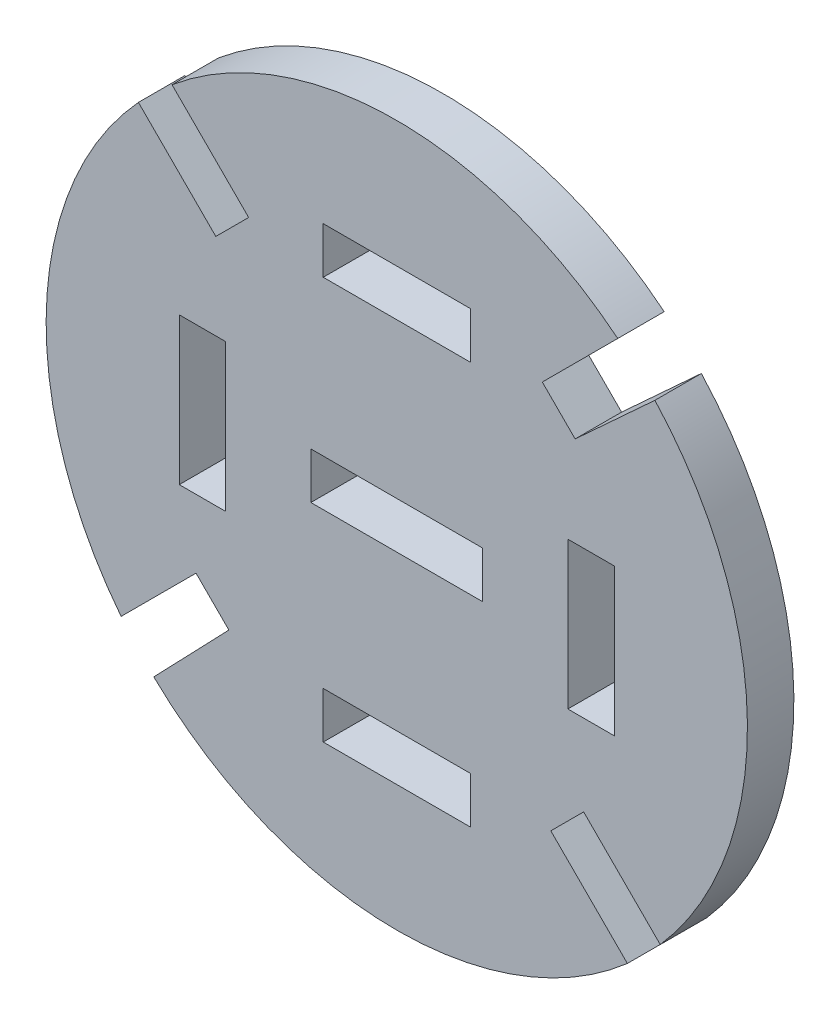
from build123d import *

# Parameters (mm, degrees)
SKETCH1_W           = 11.1
SKETCH1_H           = 3
SKETCH1_W_2         = 9.5
SKETCH1_W_3         = 3
SKETCH1_H_2         = 9.5
BOSS_EXTRUDE1_DEPTH = 3


with BuildPart() as part:
    # Sketch1 → Boss-Extrude1 (new body)
    with BuildSketch(Plane.XY):
        with BuildLine():
            Line((-11.689256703, 10.314539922), (-16.688570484, 15.313853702))
            ThreePointArc((-16.688570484, 15.313853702), (-22.633569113, 0.862582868), (-17.805715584, -13.999249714))
            Line((-17.805715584, -13.999249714), (-12.967304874, -9.160839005))
            Line((-12.967304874, -9.160839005), (-10.845984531, -11.282159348))
            Line((-10.845984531, -11.282159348), (-15.697223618, -16.328492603))
            ThreePointArc((-15.697223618, -16.328492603), (-0.543899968, -22.643468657), (14.895146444, -17.063326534))
            Line((14.895146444, -17.063326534), (9.948509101, -12.116689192))
            Line((9.948509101, -12.116689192), (12.069829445, -9.995368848))
            Line((12.069829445, -9.995368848), (17.019576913, -14.945116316))
            ThreePointArc((17.019576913, -14.945116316), (22.648523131, 0.258650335), (16.673830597, 15.329901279))
            Line((16.673830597, 15.329901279), (11.520770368, 10.592183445))
            Line((11.520770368, 10.592183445), (9.399450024, 12.713503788))
            Line((9.399450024, 12.713503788), (14.272992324, 17.587046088))
            ThreePointArc((14.272992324, 17.587046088), (-0.158470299, 22.649445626), (-14.517683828, 17.385607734))
            Line((-14.517683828, 17.385607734), (-9.56793636, 12.435860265))
            Line((-9.56793636, 12.435860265), (-11.689256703, 10.314539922))
        make_face()
        Rectangle(SKETCH1_W, SKETCH1_H, mode=Mode.SUBTRACT)
        with Locations((0, -13)):
            Rectangle(SKETCH1_W_2, SKETCH1_H, mode=Mode.SUBTRACT)
        with Locations((0, 13)):
            Rectangle(SKETCH1_W_2, SKETCH1_H, mode=Mode.SUBTRACT)
        with Locations((-12.55, 0)):
            Rectangle(SKETCH1_W_3, SKETCH1_H_2, mode=Mode.SUBTRACT)
        with Locations((12.55, 0)):
            Rectangle(SKETCH1_W_3, SKETCH1_H_2, mode=Mode.SUBTRACT)
    extrude(amount=BOSS_EXTRUDE1_DEPTH)


solid = part.part
